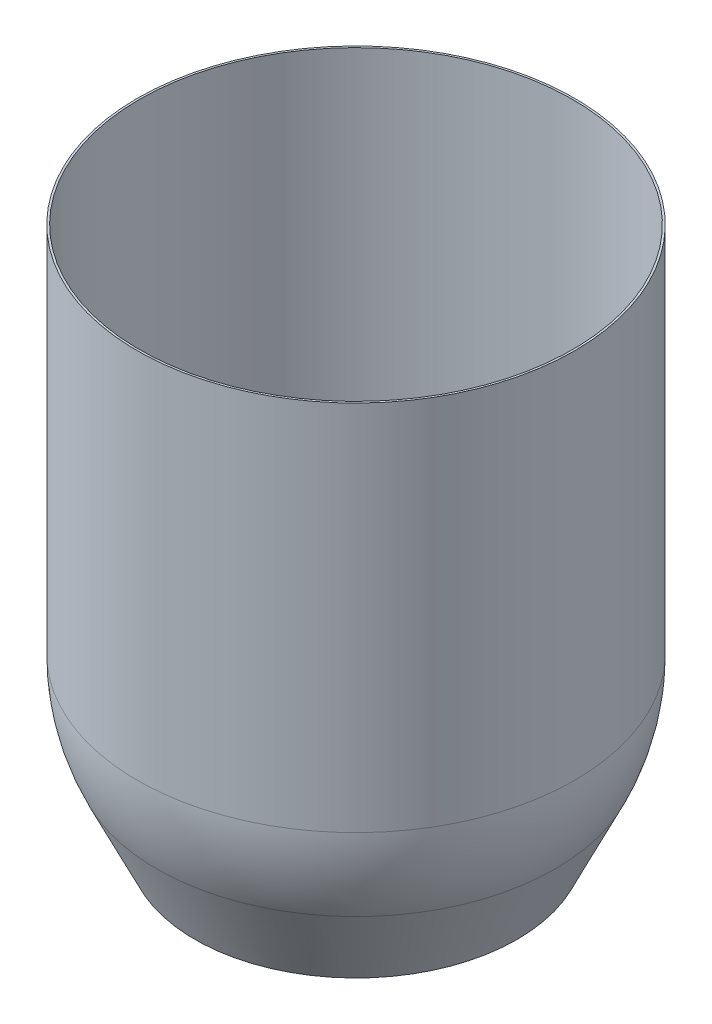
ISO-10303-21;
HEADER;
FILE_DESCRIPTION(('STEP AP214'),'2;1');
FILE_NAME('part.step','',(''),(''),'','','');
FILE_SCHEMA(('AUTOMOTIVE_DESIGN { 1 0 10303 214 1 1 1 1 }'));
ENDSEC;
DATA;
#1=APPLICATION_CONTEXT('core data for automotive mechanical design processes');
#2=APPLICATION_PROTOCOL_DEFINITION('international standard','automotive_design',2000,#1);
#3=PRODUCT_CONTEXT('',#1,'mechanical');
#4=PRODUCT('Part','Part','',(#3));
#5=PRODUCT_RELATED_PRODUCT_CATEGORY('part','',(#4));
#6=PRODUCT_DEFINITION_FORMATION('','',#4);
#7=PRODUCT_DEFINITION_CONTEXT('part definition',#1,'design');
#8=PRODUCT_DEFINITION('design','',#6,#7);
#9=PRODUCT_DEFINITION_SHAPE('','',#8);
#10=(LENGTH_UNIT() NAMED_UNIT(*) SI_UNIT(.MILLI.,.METRE.));
#11=(NAMED_UNIT(*) PLANE_ANGLE_UNIT() SI_UNIT($,.RADIAN.));
#12=(NAMED_UNIT(*) SI_UNIT($,.STERADIAN.) SOLID_ANGLE_UNIT());
#13=UNCERTAINTY_MEASURE_WITH_UNIT(LENGTH_MEASURE(1.E-05),#10,'distance_accuracy_value','');
#14=(GEOMETRIC_REPRESENTATION_CONTEXT(3) GLOBAL_UNCERTAINTY_ASSIGNED_CONTEXT((#13)) GLOBAL_UNIT_ASSIGNED_CONTEXT((#10,
#11,#12)) REPRESENTATION_CONTEXT('',''));
#15=CARTESIAN_POINT('',(0.,0.,0.));
#16=DIRECTION('',(0.,0.,1.));
#17=DIRECTION('',(1.,0.,0.));
#18=AXIS2_PLACEMENT_3D('',#15,#16,#17);
#19=CARTESIAN_POINT('',(-79.6810453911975,-211.419367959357,0.));
#20=DIRECTION('',(0.,-1.,0.));
#21=DIRECTION('',(1.,0.,0.));
#22=AXIS2_PLACEMENT_3D('',#19,#20,#21);
#23=PLANE('',#22);
#24=CARTESIAN_POINT('',(0.,-211.419367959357,0.));
#25=DIRECTION('',(0.,-1.,0.));
#26=DIRECTION('',(1.,0.,0.));
#27=AXIS2_PLACEMENT_3D('',#24,#25,#26);
#28=CIRCLE('',#27,74.);
#29=CARTESIAN_POINT('',(74.,-211.419367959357,0.));
#30=VERTEX_POINT('',#29);
#31=EDGE_CURVE('E73',#30,#30,#28,.T.);
#32=ORIENTED_EDGE('',*,*,#31,.F.);
#33=EDGE_LOOP('',(#32));
#34=FACE_BOUND('',#33,.T.);
#35=CARTESIAN_POINT('',(0.,-211.419367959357,0.));
#36=DIRECTION('',(0.,1.,0.));
#37=DIRECTION('',(-1.,0.,0.));
#38=AXIS2_PLACEMENT_3D('',#35,#36,#37);
#39=CIRCLE('',#38,80.3130970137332);
#40=CARTESIAN_POINT('',(-80.3130970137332,-211.419367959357,0.));
#41=VERTEX_POINT('',#40);
#42=EDGE_CURVE('E70',#41,#41,#39,.T.);
#43=ORIENTED_EDGE('',*,*,#42,.F.);
#44=EDGE_LOOP('',(#43));
#45=FACE_BOUND('',#44,.T.);
#46=ADVANCED_FACE('F36',(#34,#45),#23,.T.);
#47=CARTESIAN_POINT('',(-79.6810453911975,-210.419367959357,0.));
#48=DIRECTION('',(0.,-1.,0.));
#49=DIRECTION('',(1.,0.,0.));
#50=AXIS2_PLACEMENT_3D('',#47,#48,#49);
#51=PLANE('',#50);
#52=CARTESIAN_POINT('',(0.,-210.419367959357,0.));
#53=DIRECTION('',(0.,-1.,0.));
#54=DIRECTION('',(1.,0.,0.));
#55=AXIS2_PLACEMENT_3D('',#52,#53,#54);
#56=CIRCLE('',#55,74.75);
#57=CARTESIAN_POINT('',(74.75,-210.419367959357,0.));
#58=VERTEX_POINT('',#57);
#59=EDGE_CURVE('E42',#58,#58,#56,.T.);
#60=ORIENTED_EDGE('',*,*,#59,.T.);
#61=EDGE_LOOP('',(#60));
#62=FACE_BOUND('',#61,.T.);
#63=CARTESIAN_POINT('',(0.,-210.419367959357,0.));
#64=DIRECTION('',(0.,1.,0.));
#65=DIRECTION('',(-1.,0.,0.));
#66=AXIS2_PLACEMENT_3D('',#63,#64,#65);
#67=CIRCLE('',#66,79.6810453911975);
#68=CARTESIAN_POINT('',(-79.6810453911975,-210.419367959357,0.));
#69=VERTEX_POINT('',#68);
#70=EDGE_CURVE('E46',#69,#69,#67,.T.);
#71=ORIENTED_EDGE('',*,*,#70,.T.);
#72=EDGE_LOOP('',(#71));
#73=FACE_BOUND('',#72,.T.);
#74=ADVANCED_FACE('F81',(#62,#73),#51,.F.);
#75=CARTESIAN_POINT('',(0.,-171.068957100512,0.));
#76=DIRECTION('',(0.,1.,0.));
#77=DIRECTION('',(-1.,0.,0.));
#78=AXIS2_PLACEMENT_3D('',#75,#76,#77);
#79=CONICAL_SURFACE('',#78,98.374411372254,0.443488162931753);
#80=ORIENTED_EDGE('',*,*,#70,.F.);
#81=EDGE_LOOP('',(#80));
#82=FACE_BOUND('',#81,.T.);
#83=CARTESIAN_POINT('',(0.,-171.068957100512,0.));
#84=DIRECTION('',(0.,1.,0.));
#85=DIRECTION('',(-1.,0.,0.));
#86=AXIS2_PLACEMENT_3D('',#83,#84,#85);
#87=CIRCLE('',#86,98.374411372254);
#88=CARTESIAN_POINT('',(-98.3744113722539,-171.068957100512,0.));
#89=VERTEX_POINT('',#88);
#90=EDGE_CURVE('E50',#89,#89,#87,.T.);
#91=ORIENTED_EDGE('',*,*,#90,.T.);
#92=EDGE_LOOP('',(#91));
#93=FACE_BOUND('',#92,.T.);
#94=ADVANCED_FACE('F117',(#82,#93),#79,.F.);
#95=CARTESIAN_POINT('',(0.,-128.374224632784,0.));
#96=DIRECTION('',(0.,1.,0.));
#97=DIRECTION('',(-1.,0.,0.));
#98=AXIS2_PLACEMENT_3D('',#95,#96,#97);
#99=DEGENERATE_TOROIDAL_SURFACE('',#98,8.5,99.5,.T.);
#100=ORIENTED_EDGE('',*,*,#90,.F.);
#101=EDGE_LOOP('',(#100));
#102=FACE_BOUND('',#101,.T.);
#103=CARTESIAN_POINT('',(0.,-128.374224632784,0.));
#104=DIRECTION('',(0.,1.,0.));
#105=DIRECTION('',(-1.,0.,0.));
#106=AXIS2_PLACEMENT_3D('',#103,#104,#105);
#107=CIRCLE('',#106,108.);
#108=CARTESIAN_POINT('',(-108.,-128.374224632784,0.));
#109=VERTEX_POINT('',#108);
#110=EDGE_CURVE('E55',#109,#109,#107,.T.);
#111=ORIENTED_EDGE('',*,*,#110,.T.);
#112=EDGE_LOOP('',(#111));
#113=FACE_BOUND('',#112,.T.);
#114=ADVANCED_FACE('F110',(#102,#113),#99,.F.);
#115=CARTESIAN_POINT('',(0.,67.4781049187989,0.));
#116=DIRECTION('',(0.,1.,0.));
#117=DIRECTION('',(-1.,0.,0.));
#118=AXIS2_PLACEMENT_3D('',#115,#116,#117);
#119=CYLINDRICAL_SURFACE('',#118,108.);
#120=ORIENTED_EDGE('',*,*,#110,.F.);
#121=EDGE_LOOP('',(#120));
#122=FACE_BOUND('',#121,.T.);
#123=CARTESIAN_POINT('',(0.,57.0806320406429,0.));
#124=DIRECTION('',(0.,1.,0.));
#125=DIRECTION('',(-1.,0.,0.));
#126=AXIS2_PLACEMENT_3D('',#123,#124,#125);
#127=CIRCLE('',#126,108.);
#128=CARTESIAN_POINT('',(-108.,57.0806320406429,0.));
#129=VERTEX_POINT('',#128);
#130=EDGE_CURVE('E58',#129,#129,#127,.T.);
#131=ORIENTED_EDGE('',*,*,#130,.T.);
#132=EDGE_LOOP('',(#131));
#133=FACE_BOUND('',#132,.T.);
#134=ADVANCED_FACE('F104',(#122,#133),#119,.F.);
#135=CARTESIAN_POINT('',(-109.,57.0806320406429,0.));
#136=DIRECTION('',(0.,-1.,0.));
#137=DIRECTION('',(1.,0.,0.));
#138=AXIS2_PLACEMENT_3D('',#135,#136,#137);
#139=PLANE('',#138);
#140=ORIENTED_EDGE('',*,*,#130,.F.);
#141=EDGE_LOOP('',(#140));
#142=FACE_BOUND('',#141,.T.);
#143=CARTESIAN_POINT('',(0.,57.0806320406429,0.));
#144=DIRECTION('',(0.,1.,0.));
#145=DIRECTION('',(-1.,0.,0.));
#146=AXIS2_PLACEMENT_3D('',#143,#144,#145);
#147=CIRCLE('',#146,109.);
#148=CARTESIAN_POINT('',(-109.,57.0806320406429,0.));
#149=VERTEX_POINT('',#148);
#150=EDGE_CURVE('E61',#149,#149,#147,.T.);
#151=ORIENTED_EDGE('',*,*,#150,.T.);
#152=EDGE_LOOP('',(#151));
#153=FACE_BOUND('',#152,.T.);
#154=ADVANCED_FACE('F99',(#142,#153),#139,.F.);
#155=CARTESIAN_POINT('',(0.,67.4781049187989,0.));
#156=DIRECTION('',(0.,1.,0.));
#157=DIRECTION('',(-1.,0.,0.));
#158=AXIS2_PLACEMENT_3D('',#155,#156,#157);
#159=CYLINDRICAL_SURFACE('',#158,109.);
#160=CARTESIAN_POINT('',(0.,-128.374224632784,0.));
#161=DIRECTION('',(0.,1.,0.));
#162=DIRECTION('',(-1.,0.,0.));
#163=AXIS2_PLACEMENT_3D('',#160,#161,#162);
#164=CIRCLE('',#163,109.);
#165=CARTESIAN_POINT('',(-109.,-128.374224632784,0.));
#166=VERTEX_POINT('',#165);
#167=EDGE_CURVE('E64',#166,#166,#164,.T.);
#168=ORIENTED_EDGE('',*,*,#167,.T.);
#169=EDGE_LOOP('',(#168));
#170=FACE_BOUND('',#169,.T.);
#171=ORIENTED_EDGE('',*,*,#150,.F.);
#172=EDGE_LOOP('',(#171));
#173=FACE_BOUND('',#172,.T.);
#174=ADVANCED_FACE('F93',(#170,#173),#159,.T.);
#175=CARTESIAN_POINT('',(0.,-128.374224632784,0.));
#176=DIRECTION('',(0.,1.,0.));
#177=DIRECTION('',(-1.,0.,0.));
#178=AXIS2_PLACEMENT_3D('',#175,#176,#177);
#179=DEGENERATE_TOROIDAL_SURFACE('',#178,8.5,100.5,.T.);
#180=CARTESIAN_POINT('',(0.,-171.498049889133,0.));
#181=DIRECTION('',(0.,1.,0.));
#182=DIRECTION('',(-1.,0.,0.));
#183=AXIS2_PLACEMENT_3D('',#180,#181,#182);
#184=CIRCLE('',#183,99.2776717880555);
#185=CARTESIAN_POINT('',(-99.2776717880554,-171.498049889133,0.));
#186=VERTEX_POINT('',#185);
#187=EDGE_CURVE('E67',#186,#186,#184,.T.);
#188=ORIENTED_EDGE('',*,*,#187,.T.);
#189=EDGE_LOOP('',(#188));
#190=FACE_BOUND('',#189,.T.);
#191=ORIENTED_EDGE('',*,*,#167,.F.);
#192=EDGE_LOOP('',(#191));
#193=FACE_BOUND('',#192,.T.);
#194=ADVANCED_FACE('F87',(#190,#193),#179,.T.);
#195=CARTESIAN_POINT('',(0.,-171.498049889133,0.));
#196=DIRECTION('',(0.,1.,0.));
#197=DIRECTION('',(-1.,0.,0.));
#198=AXIS2_PLACEMENT_3D('',#195,#196,#197);
#199=CONICAL_SURFACE('',#198,99.2776717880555,0.443488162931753);
#200=ORIENTED_EDGE('',*,*,#42,.T.);
#201=EDGE_LOOP('',(#200));
#202=FACE_BOUND('',#201,.T.);
#203=ORIENTED_EDGE('',*,*,#187,.F.);
#204=EDGE_LOOP('',(#203));
#205=FACE_BOUND('',#204,.T.);
#206=ADVANCED_FACE('F84',(#202,#205),#199,.T.);
#207=CARTESIAN_POINT('',(0.,-201.419367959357,0.));
#208=DIRECTION('',(0.,-1.,0.));
#209=DIRECTION('',(1.,0.,0.));
#210=AXIS2_PLACEMENT_3D('',#207,#208,#209);
#211=CYLINDRICAL_SURFACE('',#210,74.);
#212=CARTESIAN_POINT('',(0.,-211.169367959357,0.));
#213=DIRECTION('',(0.,-1.,0.));
#214=DIRECTION('',(1.,0.,0.));
#215=AXIS2_PLACEMENT_3D('',#212,#213,#214);
#216=CIRCLE('',#215,74.);
#217=CARTESIAN_POINT('',(74.,-211.169367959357,0.));
#218=VERTEX_POINT('',#217);
#219=EDGE_CURVE('E10',#218,#218,#216,.F.);
#220=ORIENTED_EDGE('',*,*,#219,.T.);
#221=EDGE_LOOP('',(#220));
#222=FACE_BOUND('',#221,.T.);
#223=ORIENTED_EDGE('',*,*,#31,.T.);
#224=EDGE_LOOP('',(#223));
#225=FACE_BOUND('',#224,.T.);
#226=ADVANCED_FACE('F77',(#222,#225),#211,.F.);
#227=CARTESIAN_POINT('',(0.,-210.419367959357,0.));
#228=DIRECTION('',(0.,1.,0.));
#229=DIRECTION('',(-1.,0.,0.));
#230=AXIS2_PLACEMENT_3D('',#227,#228,#229);
#231=CONICAL_SURFACE('',#230,74.75,0.785398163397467);
#232=ORIENTED_EDGE('',*,*,#219,.F.);
#233=EDGE_LOOP('',(#232));
#234=FACE_BOUND('',#233,.T.);
#235=ORIENTED_EDGE('',*,*,#59,.F.);
#236=EDGE_LOOP('',(#235));
#237=FACE_BOUND('',#236,.T.);
#238=ADVANCED_FACE('F177',(#234,#237),#231,.F.);
#239=CLOSED_SHELL('',(#46,#74,#94,#114,#134,#154,#174,#194,#206,#226,#238));
#240=MANIFOLD_SOLID_BREP('B2',#239);
#241=ADVANCED_BREP_SHAPE_REPRESENTATION('',(#18,#240),#14);
#242=SHAPE_DEFINITION_REPRESENTATION(#9,#241);
ENDSEC;
END-ISO-10303-21;
